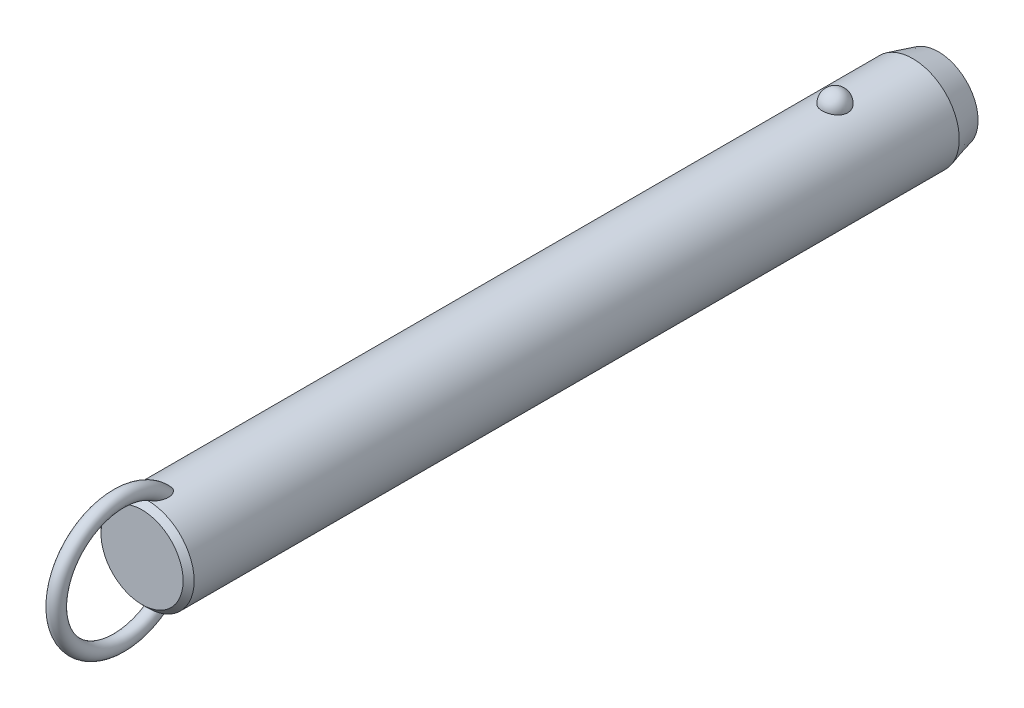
ISO-10303-21;
HEADER;
FILE_DESCRIPTION(('STEP AP214'),'2;1');
FILE_NAME('part.step','',(''),(''),'','','');
FILE_SCHEMA(('AUTOMOTIVE_DESIGN { 1 0 10303 214 1 1 1 1 }'));
ENDSEC;
DATA;
#1=APPLICATION_CONTEXT('core data for automotive mechanical design processes');
#2=APPLICATION_PROTOCOL_DEFINITION('international standard','automotive_design',2000,#1);
#3=PRODUCT_CONTEXT('',#1,'mechanical');
#4=PRODUCT('Part','Part','',(#3));
#5=PRODUCT_RELATED_PRODUCT_CATEGORY('part','',(#4));
#6=PRODUCT_DEFINITION_FORMATION('','',#4);
#7=PRODUCT_DEFINITION_CONTEXT('part definition',#1,'design');
#8=PRODUCT_DEFINITION('design','',#6,#7);
#9=PRODUCT_DEFINITION_SHAPE('','',#8);
#10=(LENGTH_UNIT() NAMED_UNIT(*) SI_UNIT(.MILLI.,.METRE.));
#11=(NAMED_UNIT(*) PLANE_ANGLE_UNIT() SI_UNIT($,.RADIAN.));
#12=(NAMED_UNIT(*) SI_UNIT($,.STERADIAN.) SOLID_ANGLE_UNIT());
#13=UNCERTAINTY_MEASURE_WITH_UNIT(LENGTH_MEASURE(1.E-05),#10,'distance_accuracy_value','');
#14=(GEOMETRIC_REPRESENTATION_CONTEXT(3) GLOBAL_UNCERTAINTY_ASSIGNED_CONTEXT((#13)) GLOBAL_UNIT_ASSIGNED_CONTEXT((#10,
#11,#12)) REPRESENTATION_CONTEXT('',''));
#15=CARTESIAN_POINT('',(0.,0.,0.));
#16=DIRECTION('',(0.,0.,1.));
#17=DIRECTION('',(1.,0.,0.));
#18=AXIS2_PLACEMENT_3D('',#15,#16,#17);
#19=CARTESIAN_POINT('',(0.,0.,172.8));
#20=DIRECTION('',(0.,0.,-1.));
#21=DIRECTION('',(-1.,0.,0.));
#22=AXIS2_PLACEMENT_3D('',#19,#20,#21);
#23=CYLINDRICAL_SURFACE('',#22,12.7);
#24=CARTESIAN_POINT('',(3.46661256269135,12.2177165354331,-3.50000000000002));
#25=CARTESIAN_POINT('',(3.4666090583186,12.2177194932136,-3.30432790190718));
#26=CARTESIAN_POINT('',(3.45063567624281,12.2222841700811,-3.10861112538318));
#27=CARTESIAN_POINT('',(3.38712451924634,12.2400345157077,-2.72271899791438));
#28=CARTESIAN_POINT('',(3.33957415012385,12.2532236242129,-2.53254588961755));
#29=CARTESIAN_POINT('',(3.2141234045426,12.286724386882,-2.16324948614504));
#30=CARTESIAN_POINT('',(3.13623639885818,12.3070329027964,-1.98412136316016));
#31=CARTESIAN_POINT('',(2.95205930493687,12.3525018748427,-1.6418059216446));
#32=CARTESIAN_POINT('',(2.84577003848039,12.3776621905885,-1.47861814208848));
#33=CARTESIAN_POINT('',(2.60688050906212,12.4301712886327,-1.17190583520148));
#34=CARTESIAN_POINT('',(2.47415697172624,12.4575299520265,-1.0284789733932));
#35=CARTESIAN_POINT('',(2.18615174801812,12.5112810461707,-0.766177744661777));
#36=CARTESIAN_POINT('',(2.03087002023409,12.5376734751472,-0.647303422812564));
#37=CARTESIAN_POINT('',(1.70237334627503,12.5864761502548,-0.437732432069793));
#38=CARTESIAN_POINT('',(1.52920948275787,12.6088972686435,-0.34695830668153));
#39=CARTESIAN_POINT('',(1.16944170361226,12.6473352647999,-0.195750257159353));
#40=CARTESIAN_POINT('',(0.982839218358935,12.663352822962,-0.135313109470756));
#41=CARTESIAN_POINT('',(0.604961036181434,12.6869706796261,-0.0473241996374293));
#42=CARTESIAN_POINT('',(0.413823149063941,12.6947125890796,-0.0192185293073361));
#43=CARTESIAN_POINT('',(0.0293827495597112,12.7014203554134,0.00517254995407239));
#44=CARTESIAN_POINT('',(-0.163919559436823,12.7003870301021,0.00146092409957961));
#45=CARTESIAN_POINT('',(-0.544374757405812,12.689735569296,-0.037393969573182));
#46=CARTESIAN_POINT('',(-0.731575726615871,12.6802364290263,-0.0721015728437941));
#47=CARTESIAN_POINT('',(-1.09733277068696,12.6538333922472,-0.171364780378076));
#48=CARTESIAN_POINT('',(-1.27588869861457,12.6369293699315,-0.235920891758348));
#49=CARTESIAN_POINT('',(-1.6204698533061,12.5973946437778,-0.393548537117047));
#50=CARTESIAN_POINT('',(-1.78641865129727,12.5747321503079,-0.486778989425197));
#51=CARTESIAN_POINT('',(-2.10030671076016,12.5261316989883,-0.699110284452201));
#52=CARTESIAN_POINT('',(-2.24824419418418,12.5001934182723,-0.818213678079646));
#53=CARTESIAN_POINT('',(-2.52491489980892,12.4472906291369,-1.0815712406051));
#54=CARTESIAN_POINT('',(-2.65324222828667,12.4203160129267,-1.22624992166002));
#55=CARTESIAN_POINT('',(-2.88410007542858,12.3687509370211,-1.53528325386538));
#56=CARTESIAN_POINT('',(-2.98662883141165,12.3441606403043,-1.69963924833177));
#57=CARTESIAN_POINT('',(-3.16432417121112,12.2998199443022,-2.04548497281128));
#58=CARTESIAN_POINT('',(-3.23917525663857,12.2801261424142,-2.22714424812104));
#59=CARTESIAN_POINT('',(-3.35800573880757,12.248167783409,-2.60091389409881));
#60=CARTESIAN_POINT('',(-3.4019860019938,12.2359030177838,-2.79302397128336));
#61=CARTESIAN_POINT('',(-3.45784812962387,12.2202347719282,-3.18140279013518));
#62=CARTESIAN_POINT('',(-3.46986123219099,12.2167950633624,-3.37765118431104));
#63=CARTESIAN_POINT('',(-3.46186273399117,12.2190638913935,-3.76943689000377));
#64=CARTESIAN_POINT('',(-3.44185196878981,12.2247721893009,-3.96497421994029));
#65=CARTESIAN_POINT('',(-3.37048652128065,12.2446381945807,-4.34881728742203));
#66=CARTESIAN_POINT('',(-3.31928253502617,12.2587552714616,-4.53715319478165));
#67=CARTESIAN_POINT('',(-3.18693461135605,12.2938237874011,-4.9023172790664));
#68=CARTESIAN_POINT('',(-3.1057895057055,12.3147754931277,-5.07914500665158));
#69=CARTESIAN_POINT('',(-2.91506431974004,12.3613125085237,-5.41732059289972));
#70=CARTESIAN_POINT('',(-2.80533587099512,12.3869217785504,-5.57858147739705));
#71=CARTESIAN_POINT('',(-2.560414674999,12.4398525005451,-5.88013283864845));
#72=CARTESIAN_POINT('',(-2.42522099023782,12.4671740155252,-6.02042254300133));
#73=CARTESIAN_POINT('',(-2.1323357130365,12.5205965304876,-6.27662798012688));
#74=CARTESIAN_POINT('',(-1.97456596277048,12.5466928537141,-6.39245542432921));
#75=CARTESIAN_POINT('',(-1.64115839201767,12.5946384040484,-6.59583547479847));
#76=CARTESIAN_POINT('',(-1.46552179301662,12.6164879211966,-6.68339001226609));
#77=CARTESIAN_POINT('',(-1.10356050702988,12.6532533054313,-6.82682153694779));
#78=CARTESIAN_POINT('',(-0.917391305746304,12.6682500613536,-6.88306988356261));
#79=CARTESIAN_POINT('',(-0.537836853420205,12.6900288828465,-6.96386887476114));
#80=CARTESIAN_POINT('',(-0.344452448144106,12.6968119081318,-6.98842322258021));
#81=CARTESIAN_POINT('',(0.0402577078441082,12.7013667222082,-7.00496469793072));
#82=CARTESIAN_POINT('',(0.231556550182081,12.6993008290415,-6.99753844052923));
#83=CARTESIAN_POINT('',(0.610105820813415,12.6867505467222,-6.95166366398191));
#84=CARTESIAN_POINT('',(0.797356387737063,12.6762664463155,-6.91321620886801));
#85=CARTESIAN_POINT('',(1.16186657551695,12.6480587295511,-6.80658431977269));
#86=CARTESIAN_POINT('',(1.33915951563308,12.6303611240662,-6.73850666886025));
#87=CARTESIAN_POINT('',(1.67968518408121,12.5896027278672,-6.57450875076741));
#88=CARTESIAN_POINT('',(1.84291705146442,12.5665416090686,-6.47858678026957));
#89=CARTESIAN_POINT('',(2.15340192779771,12.5171072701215,-6.25982455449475));
#90=CARTESIAN_POINT('',(2.30037831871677,12.4906895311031,-6.13660186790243));
#91=CARTESIAN_POINT('',(2.5717412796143,12.4376567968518,-5.86739587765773));
#92=CARTESIAN_POINT('',(2.69612388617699,12.4110417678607,-5.72140858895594));
#93=CARTESIAN_POINT('',(2.92107785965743,12.360051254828,-5.40794137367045));
#94=CARTESIAN_POINT('',(3.02121329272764,12.3357209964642,-5.24014110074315));
#95=CARTESIAN_POINT('',(3.19236291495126,12.2925446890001,-4.88969865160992));
#96=CARTESIAN_POINT('',(3.26338839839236,12.2736965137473,-4.70706226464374));
#97=CARTESIAN_POINT('',(3.36788038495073,12.245404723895,-4.35469510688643));
#98=CARTESIAN_POINT('',(3.40484026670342,12.2351018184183,-4.18605935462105));
#99=CARTESIAN_POINT('',(3.45420764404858,12.2212564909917,-3.84496058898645));
#100=CARTESIAN_POINT('',(3.46661565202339,12.2177139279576,-3.67249765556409));
#101=CARTESIAN_POINT('',(3.46661256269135,12.2177165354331,-3.50000000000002));
#102=B_SPLINE_CURVE_WITH_KNOTS('',3,(#24,#25,#26,#27,#28,#29,#30,#31,#32,#33,#34,#35,#36,#37,
#38,#39,#40,#41,#42,#43,#44,#45,#46,#47,#48,#49,#50,#51,#52,#53,#54,#55,#56,#57,#58,#59,#60,#61,
#62,#63,#64,#65,#66,#67,#68,#69,#70,#71,#72,#73,#74,#75,#76,#77,#78,#79,#80,#81,#82,#83,#84,#85,
#86,#87,#88,#89,#90,#91,#92,#93,#94,#95,#96,#97,#98,#99,#100,#101),.UNSPECIFIED.,.T.,.F.,(4,2,2,
2,2,2,2,2,2,2,2,2,2,2,2,2,2,2,2,2,2,2,2,2,2,2,2,2,2,2,2,2,2,2,2,2,2,2,4),(0.,0.586396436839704,
1.17302689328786,1.7593990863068,2.34575431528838,2.93491084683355,3.52406845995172,
4.11158733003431,4.69904375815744,5.2762784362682,5.85345931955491,6.42265312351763,
6.99185659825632,7.56427334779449,8.136746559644,8.71981013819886,9.3029135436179,
9.89247258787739,10.4820150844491,11.0691335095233,11.6562366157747,12.2405256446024,
12.8248374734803,13.412244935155,13.9996740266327,14.5891883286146,15.1786623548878,
15.7609861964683,16.3432419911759,16.914863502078,17.4864654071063,18.056024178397,
18.6256177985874,19.2037609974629,19.7820055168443,20.3699810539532,20.9577282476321,
21.4746855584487,21.9916320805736),.UNSPECIFIED.);
#103=CARTESIAN_POINT('',(3.46661256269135,12.2177165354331,-3.50000000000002));
#104=VERTEX_POINT('',#103);
#105=EDGE_CURVE('E41',#104,#104,#102,.T.);
#106=ORIENTED_EDGE('',*,*,#105,.T.);
#107=EDGE_LOOP('',(#106));
#108=FACE_BOUND('',#107,.T.);
#109=CARTESIAN_POINT('',(0.,0.,184.));
#110=DIRECTION('',(0.,0.,1.));
#111=DIRECTION('',(1.,0.,0.));
#112=AXIS2_PLACEMENT_3D('',#109,#110,#111);
#113=CIRCLE('',#112,12.7);
#114=CARTESIAN_POINT('',(12.7,0.,184.));
#115=VERTEX_POINT('',#114);
#116=EDGE_CURVE('E10',#115,#115,#113,.F.);
#117=ORIENTED_EDGE('',*,*,#116,.T.);
#118=EDGE_LOOP('',(#117));
#119=FACE_BOUND('',#118,.T.);
#120=CARTESIAN_POINT('',(-0.548122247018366,-12.6881662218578,177.743218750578));
#121=CARTESIAN_POINT('',(-0.648865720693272,-12.6838128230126,177.777926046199));
#122=CARTESIAN_POINT('',(-0.746398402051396,-12.6783867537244,177.822042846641));
#123=CARTESIAN_POINT('',(-0.932125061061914,-12.666091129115,177.926764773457));
#124=CARTESIAN_POINT('',(-1.02030388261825,-12.6592192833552,177.987396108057));
#125=CARTESIAN_POINT('',(-1.18487740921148,-12.6448747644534,178.121847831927));
#126=CARTESIAN_POINT('',(-1.26134296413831,-12.637406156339,178.195582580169));
#127=CARTESIAN_POINT('',(-1.4023120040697,-12.6225412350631,178.353604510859));
#128=CARTESIAN_POINT('',(-1.466814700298,-12.6151449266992,178.43789238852));
#129=CARTESIAN_POINT('',(-1.60714786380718,-12.5981718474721,178.649657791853));
#130=CARTESIAN_POINT('',(-1.67725126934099,-12.588900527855,178.780962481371));
#131=CARTESIAN_POINT('',(-1.79536591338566,-12.5725964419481,179.053247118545));
#132=CARTESIAN_POINT('',(-1.84333535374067,-12.5655679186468,179.194244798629));
#133=CARTESIAN_POINT('',(-1.93422576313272,-12.5519624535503,179.537645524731));
#134=CARTESIAN_POINT('',(-1.96788773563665,-12.5466298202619,179.742557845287));
#135=CARTESIAN_POINT('',(-1.9941399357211,-12.542463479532,180.051760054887));
#136=CARTESIAN_POINT('',(-1.99883864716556,-12.5417153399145,180.155298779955));
#137=CARTESIAN_POINT('',(-2.00078003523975,-12.5414074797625,180.36245124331));
#138=CARTESIAN_POINT('',(-1.99802449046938,-12.5418474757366,180.466064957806));
#139=CARTESIAN_POINT('',(-1.98336733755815,-12.5441750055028,180.71032076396));
#140=CARTESIAN_POINT('',(-1.96851430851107,-12.5465291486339,180.850780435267));
#141=CARTESIAN_POINT('',(-1.92707089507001,-12.5529612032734,181.129960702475));
#142=CARTESIAN_POINT('',(-1.90047458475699,-12.5570399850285,181.268680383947));
#143=CARTESIAN_POINT('',(-1.83619120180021,-12.5666008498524,181.54341135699));
#144=CARTESIAN_POINT('',(-1.79850828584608,-12.57208240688,181.679423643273));
#145=CARTESIAN_POINT('',(-1.71223796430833,-12.5841228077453,181.947842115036));
#146=CARTESIAN_POINT('',(-1.66365679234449,-12.5906810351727,182.080250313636));
#147=CARTESIAN_POINT('',(-1.57804503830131,-12.6016176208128,182.28548877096));
#148=CARTESIAN_POINT('',(-1.54477252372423,-12.6057501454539,182.359914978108));
#149=CARTESIAN_POINT('',(-1.47424480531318,-12.6141930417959,182.506839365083));
#150=CARTESIAN_POINT('',(-1.43699041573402,-12.6185033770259,182.579337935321));
#151=CARTESIAN_POINT('',(-1.35825795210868,-12.6272207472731,182.721892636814));
#152=CARTESIAN_POINT('',(-1.31678520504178,-12.6316276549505,182.791951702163));
#153=CARTESIAN_POINT('',(-1.22917793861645,-12.6404532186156,182.929070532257));
#154=CARTESIAN_POINT('',(-1.18304514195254,-12.6448718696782,182.996131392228));
#155=CARTESIAN_POINT('',(-1.07246411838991,-12.6547893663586,183.143874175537));
#156=CARTESIAN_POINT('',(-1.0064223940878,-12.6602600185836,183.223384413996));
#157=CARTESIAN_POINT('',(-0.864441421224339,-12.6707460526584,183.373169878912));
#158=CARTESIAN_POINT('',(-0.788516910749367,-12.6757620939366,183.443458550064));
#159=CARTESIAN_POINT('',(-0.65221547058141,-12.6833591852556,183.548680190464));
#160=CARTESIAN_POINT('',(-0.59498203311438,-12.6861973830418,183.587624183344));
#161=CARTESIAN_POINT('',(-0.475269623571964,-12.6912445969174,183.656489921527));
#162=CARTESIAN_POINT('',(-0.41280013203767,-12.6934547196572,183.686427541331));
#163=CARTESIAN_POINT('',(-0.295749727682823,-12.6966636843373,183.729756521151));
#164=CARTESIAN_POINT('',(-0.2419499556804,-12.6978134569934,183.745218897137));
#165=CARTESIAN_POINT('',(-0.13250810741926,-12.6994261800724,183.766884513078));
#166=CARTESIAN_POINT('',(-0.0768679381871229,-12.6998898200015,183.773097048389));
#167=CARTESIAN_POINT('',(0.0347696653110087,-12.7000752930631,183.775583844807));
#168=CARTESIAN_POINT('',(0.0907676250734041,-12.6997954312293,183.771835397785));
#169=CARTESIAN_POINT('',(0.201283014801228,-12.6985255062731,183.754788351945));
#170=CARTESIAN_POINT('',(0.255799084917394,-12.6975348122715,183.741481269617));
#171=CARTESIAN_POINT('',(0.376042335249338,-12.6946091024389,183.70203792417));
#172=CARTESIAN_POINT('',(0.440950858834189,-12.6924943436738,183.673449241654));
#173=CARTESIAN_POINT('',(0.565350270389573,-12.6875639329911,183.606323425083));
#174=CARTESIAN_POINT('',(0.624828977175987,-12.6847467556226,183.567764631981));
#175=CARTESIAN_POINT('',(0.774116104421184,-12.6767252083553,183.456949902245));
#176=CARTESIAN_POINT('',(0.859449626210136,-12.6711344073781,183.378760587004));
#177=CARTESIAN_POINT('',(1.01789440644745,-12.6593922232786,183.210943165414));
#178=CARTESIAN_POINT('',(1.09096902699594,-12.653239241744,183.121282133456));
#179=CARTESIAN_POINT('',(1.22268793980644,-12.6411674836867,182.940265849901));
#180=CARTESIAN_POINT('',(1.28193986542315,-12.6352572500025,182.849345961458));
#181=CARTESIAN_POINT('',(1.39259777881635,-12.6235401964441,182.662792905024));
#182=CARTESIAN_POINT('',(1.44399707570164,-12.6177334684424,182.567155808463));
#183=CARTESIAN_POINT('',(1.53972870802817,-12.6064093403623,182.372273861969));
#184=CARTESIAN_POINT('',(1.58405262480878,-12.6008922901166,182.273024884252));
#185=CARTESIAN_POINT('',(1.66600705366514,-12.5903187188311,182.071772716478));
#186=CARTESIAN_POINT('',(1.70363651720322,-12.5852622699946,181.969769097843));
#187=CARTESIAN_POINT('',(1.77545379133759,-12.5753406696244,181.754358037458));
#188=CARTESIAN_POINT('',(1.80903453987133,-12.5705328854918,181.640745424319));
#189=CARTESIAN_POINT('',(1.86844163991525,-12.5618400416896,181.411457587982));
#190=CARTESIAN_POINT('',(1.89426665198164,-12.5579551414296,181.295782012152));
#191=CARTESIAN_POINT('',(1.93785464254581,-12.5513030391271,181.063007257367));
#192=CARTESIAN_POINT('',(1.95562640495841,-12.5485346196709,180.945909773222));
#193=CARTESIAN_POINT('',(1.98264463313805,-12.5442934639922,180.710747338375));
#194=CARTESIAN_POINT('',(1.99189298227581,-12.5428204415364,180.59268260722));
#195=CARTESIAN_POINT('',(2.00416068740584,-12.540871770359,180.280622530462));
#196=CARTESIAN_POINT('',(1.99944433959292,-12.541631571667,180.086229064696));
#197=CARTESIAN_POINT('',(1.96113755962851,-12.5476846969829,179.700309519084));
#198=CARTESIAN_POINT('',(1.92758341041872,-12.5529723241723,179.508780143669));
#199=CARTESIAN_POINT('',(1.83934342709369,-12.5661532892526,179.182272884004));
#200=CARTESIAN_POINT('',(1.79215440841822,-12.5730485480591,179.04524997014));
#201=CARTESIAN_POINT('',(1.67676242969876,-12.588958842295,178.780445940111));
#202=CARTESIAN_POINT('',(1.60859050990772,-12.597970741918,178.652651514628));
#203=CARTESIAN_POINT('',(1.46583832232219,-12.6152829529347,178.435800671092));
#204=CARTESIAN_POINT('',(1.39525727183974,-12.6233659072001,178.34410500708));
#205=CARTESIAN_POINT('',(1.23992594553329,-12.6395676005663,178.173485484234));
#206=CARTESIAN_POINT('',(1.15517932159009,-12.6476863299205,178.094558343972));
#207=CARTESIAN_POINT('',(0.971995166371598,-12.6630846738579,177.952643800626));
#208=CARTESIAN_POINT('',(0.873456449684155,-12.6703572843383,177.889784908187));
#209=CARTESIAN_POINT('',(0.665847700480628,-12.6829569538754,177.784487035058));
#210=CARTESIAN_POINT('',(0.556784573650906,-12.688285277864,177.742034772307));
#211=CARTESIAN_POINT('',(0.347338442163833,-12.6956226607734,177.684443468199));
#212=CARTESIAN_POINT('',(0.247759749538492,-12.6979816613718,177.666399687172));
#213=CARTESIAN_POINT('',(0.0470218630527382,-12.7003077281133,177.648600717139));
#214=CARTESIAN_POINT('',(-0.0541350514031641,-12.7002779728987,177.648821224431));
#215=CARTESIAN_POINT('',(-0.221414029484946,-12.6982482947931,177.664363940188));
#216=CARTESIAN_POINT('',(-0.288055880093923,-12.6969033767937,177.674666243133));
#217=CARTESIAN_POINT('',(-0.419599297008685,-12.6932369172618,177.70313489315));
#218=CARTESIAN_POINT('',(-0.484501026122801,-12.6909154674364,177.721300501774));
#219=CARTESIAN_POINT('',(-0.548122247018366,-12.6881662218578,177.743218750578));
#220=B_SPLINE_CURVE_WITH_KNOTS('',3,(#120,#121,#122,#123,#124,#125,#126,#127,#128,#129,#130,
#131,#132,#133,#134,#135,#136,#137,#138,#139,#140,#141,#142,#143,#144,#145,#146,#147,#148,#149,
#150,#151,#152,#153,#154,#155,#156,#157,#158,#159,#160,#161,#162,#163,#164,#165,#166,#167,#168,
#169,#170,#171,#172,#173,#174,#175,#176,#177,#178,#179,#180,#181,#182,#183,#184,#185,#186,#187,
#188,#189,#190,#191,#192,#193,#194,#195,#196,#197,#198,#199,#200,#201,#202,#203,#204,#205,#206,
#207,#208,#209,#210,#211,#212,#213,#214,#215,#216,#217,#218,#219),.UNSPECIFIED.,.T.,.F.,(4,2,2,
2,2,2,2,2,2,2,2,2,2,2,2,2,2,2,2,2,2,2,2,2,2,2,2,2,2,2,2,2,2,2,2,2,2,2,2,2,2,2,2,2,2,2,2,2,2,4),
(0.,0.31964225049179,0.639794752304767,0.957927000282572,1.27608021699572,1.72100165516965,
2.16675988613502,2.78630021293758,3.09705782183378,3.40774128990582,3.83096358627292,
4.25439969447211,4.67767724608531,5.1007133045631,5.34550297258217,5.59024267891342,
5.83467707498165,6.07902143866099,6.38891080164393,6.69834321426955,6.9056091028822,
7.11250749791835,7.27977315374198,7.44687060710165,7.61434932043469,7.78197685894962,
7.99365544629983,8.20579780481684,8.55147335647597,8.89816429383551,9.22375138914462,
9.54961437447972,9.87586224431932,10.202161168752,10.557587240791,10.9130746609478,
11.2681734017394,11.6231936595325,12.2046601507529,12.7853961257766,13.219164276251,
13.6522938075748,13.9989174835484,14.3454519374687,14.6946768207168,15.0436740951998,
15.3457513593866,15.6474266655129,15.8493051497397,16.0511646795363),.UNSPECIFIED.);
#221=CARTESIAN_POINT('',(-0.548122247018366,-12.6881662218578,177.743218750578));
#222=VERTEX_POINT('',#221);
#223=EDGE_CURVE('E59',#222,#222,#220,.T.);
#224=ORIENTED_EDGE('',*,*,#223,.T.);
#225=EDGE_LOOP('',(#224));
#226=FACE_BOUND('',#225,.T.);
#227=CARTESIAN_POINT('',(-0.548122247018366,12.6881662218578,177.743218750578));
#228=CARTESIAN_POINT('',(-0.459436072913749,12.6919968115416,177.712673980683));
#229=CARTESIAN_POINT('',(-0.368189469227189,12.6949996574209,177.689391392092));
#230=CARTESIAN_POINT('',(-0.18302400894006,12.6990186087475,177.658406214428));
#231=CARTESIAN_POINT('',(-0.089104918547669,12.7000345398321,177.650704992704));
#232=CARTESIAN_POINT('',(0.0987147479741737,12.6999636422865,177.651245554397));
#233=CARTESIAN_POINT('',(0.192615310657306,12.6988761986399,177.659492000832));
#234=CARTESIAN_POINT('',(0.377658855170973,12.6947211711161,177.691551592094));
#235=CARTESIAN_POINT('',(0.468801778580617,12.6916535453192,177.715365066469));
#236=CARTESIAN_POINT('',(0.645809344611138,12.6838788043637,177.77745651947));
#237=CARTESIAN_POINT('',(0.731679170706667,12.6791733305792,177.815720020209));
#238=CARTESIAN_POINT('',(0.896315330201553,12.6686004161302,177.905120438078));
#239=CARTESIAN_POINT('',(0.97508059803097,12.6627328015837,177.956259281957));
#240=CARTESIAN_POINT('',(1.12963655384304,12.6499161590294,178.07367820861));
#241=CARTESIAN_POINT('',(1.20478673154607,12.6429194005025,178.140792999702));
#242=CARTESIAN_POINT('',(1.34448241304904,12.6288282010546,178.28522507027));
#243=CARTESIAN_POINT('',(1.40902173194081,12.621733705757,178.362548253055));
#244=CARTESIAN_POINT('',(1.55208211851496,12.6050877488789,178.559247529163));
#245=CARTESIAN_POINT('',(1.62510490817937,12.5957546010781,178.682654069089));
#246=CARTESIAN_POINT('',(1.7501904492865,12.5789823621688,178.939769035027));
#247=CARTESIAN_POINT('',(1.80221377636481,12.5715468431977,179.073496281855));
#248=CARTESIAN_POINT('',(1.90309965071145,12.5567434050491,179.398351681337));
#249=CARTESIAN_POINT('',(1.94342317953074,12.5504515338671,179.592161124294));
#250=CARTESIAN_POINT('',(1.99332997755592,12.5426147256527,179.98378810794));
#251=CARTESIAN_POINT('',(2.00285305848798,12.5410790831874,180.181612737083));
#252=CARTESIAN_POINT('',(1.99678999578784,12.5420407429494,180.516642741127));
#253=CARTESIAN_POINT('',(1.98794117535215,12.5434564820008,180.654042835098));
#254=CARTESIAN_POINT('',(1.95865119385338,12.5480641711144,180.927639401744));
#255=CARTESIAN_POINT('',(1.93820436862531,12.5512569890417,181.063835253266));
#256=CARTESIAN_POINT('',(1.88647896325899,12.5591352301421,181.334249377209));
#257=CARTESIAN_POINT('',(1.85518800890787,12.5638223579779,181.468465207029));
#258=CARTESIAN_POINT('',(1.78217886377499,12.5743868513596,181.733936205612));
#259=CARTESIAN_POINT('',(1.74046509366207,12.5802637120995,181.865192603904));
#260=CARTESIAN_POINT('',(1.66024095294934,12.5910571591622,182.086085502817));
#261=CARTESIAN_POINT('',(1.62434772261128,12.5957535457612,182.176690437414));
#262=CARTESIAN_POINT('',(1.54709009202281,12.6054762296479,182.355512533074));
#263=CARTESIAN_POINT('',(1.50572681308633,12.6105024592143,182.443730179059));
#264=CARTESIAN_POINT('',(1.41728020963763,12.620748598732,182.616932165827));
#265=CARTESIAN_POINT('',(1.37021377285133,12.625967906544,182.701925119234));
#266=CARTESIAN_POINT('',(1.26969620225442,12.6364721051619,182.868007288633));
#267=CARTESIAN_POINT('',(1.21624929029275,12.6417569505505,182.949099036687));
#268=CARTESIAN_POINT('',(1.10304413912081,12.6521331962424,183.104702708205));
#269=CARTESIAN_POINT('',(1.04340936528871,12.657226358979,183.179303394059));
#270=CARTESIAN_POINT('',(0.915919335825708,12.667090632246,183.321324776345));
#271=CARTESIAN_POINT('',(0.84806456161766,12.6718617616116,183.38874589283));
#272=CARTESIAN_POINT('',(0.717035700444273,12.67987711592,183.500624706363));
#273=CARTESIAN_POINT('',(0.655526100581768,12.6832377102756,183.546997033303));
#274=CARTESIAN_POINT('',(0.525985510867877,12.6892676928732,183.629619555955));
#275=CARTESIAN_POINT('',(0.457969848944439,12.6919386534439,183.665892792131));
#276=CARTESIAN_POINT('',(0.334859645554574,12.695691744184,183.716657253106));
#277=CARTESIAN_POINT('',(0.281116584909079,12.6970073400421,183.734373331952));
#278=CARTESIAN_POINT('',(0.171425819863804,12.6989609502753,183.760642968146));
#279=CARTESIAN_POINT('',(0.115480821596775,12.699599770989,183.769207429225));
#280=CARTESIAN_POINT('',(0.00272618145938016,12.7001251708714,183.776253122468));
#281=CARTESIAN_POINT('',(-0.0540859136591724,12.7000089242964,183.774696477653));
#282=CARTESIAN_POINT('',(-0.16654462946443,12.6990328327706,183.761600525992));
#283=CARTESIAN_POINT('',(-0.222190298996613,12.6981724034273,183.750053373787));
#284=CARTESIAN_POINT('',(-0.342018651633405,12.695562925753,183.714912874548));
#285=CARTESIAN_POINT('',(-0.405606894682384,12.6936676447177,183.68933225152));
#286=CARTESIAN_POINT('',(-0.527815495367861,12.6891754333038,183.628311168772));
#287=CARTESIAN_POINT('',(-0.586425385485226,12.6865770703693,183.592850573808));
#288=CARTESIAN_POINT('',(-0.731842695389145,12.6792129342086,183.491496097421));
#289=CARTESIAN_POINT('',(-0.81470941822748,12.6740767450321,183.4200395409));
#290=CARTESIAN_POINT('',(-0.969101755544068,12.6632083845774,183.26589007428));
#291=CARTESIAN_POINT('',(-1.04059564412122,12.6574746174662,183.183166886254));
#292=CARTESIAN_POINT('',(-1.16981116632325,12.6461638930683,183.015809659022));
#293=CARTESIAN_POINT('',(-1.22811369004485,12.6405994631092,182.931616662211));
#294=CARTESIAN_POINT('',(-1.33743405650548,12.6295007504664,182.758579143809));
#295=CARTESIAN_POINT('',(-1.38844577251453,12.6239664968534,182.669730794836));
#296=CARTESIAN_POINT('',(-1.48400702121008,12.6130898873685,182.488389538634));
#297=CARTESIAN_POINT('',(-1.52854232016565,12.6077479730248,182.395889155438));
#298=CARTESIAN_POINT('',(-1.61150113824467,12.5974127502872,182.208160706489));
#299=CARTESIAN_POINT('',(-1.64992317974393,12.5924195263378,182.112931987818));
#300=CARTESIAN_POINT('',(-1.73468589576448,12.581070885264,181.88289362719));
#301=CARTESIAN_POINT('',(-1.77831261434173,12.5749388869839,181.747066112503));
#302=CARTESIAN_POINT('',(-1.85439734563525,12.5639437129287,181.472212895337));
#303=CARTESIAN_POINT('',(-1.88684994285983,12.5590811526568,181.333185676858));
#304=CARTESIAN_POINT('',(-1.94008483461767,12.550968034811,181.05309235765));
#305=CARTESIAN_POINT('',(-1.96088706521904,12.5477147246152,180.912030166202));
#306=CARTESIAN_POINT('',(-1.99000539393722,12.5431291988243,180.628668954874));
#307=CARTESIAN_POINT('',(-1.99832911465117,12.5417958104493,180.486370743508));
#308=CARTESIAN_POINT('',(-2.00166624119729,12.5412674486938,180.157627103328));
#309=CARTESIAN_POINT('',(-1.99178843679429,12.5428579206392,179.971088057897));
#310=CARTESIAN_POINT('',(-1.94455183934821,12.5502731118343,179.60162404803));
#311=CARTESIAN_POINT('',(-1.90724032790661,12.5560905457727,179.418693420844));
#312=CARTESIAN_POINT('',(-1.81330718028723,12.5699462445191,179.104848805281));
#313=CARTESIAN_POINT('',(-1.76338820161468,12.5771273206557,178.971910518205));
#314=CARTESIAN_POINT('',(-1.64305018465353,12.593414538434,178.715681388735));
#315=CARTESIAN_POINT('',(-1.57265346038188,12.6025185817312,178.592380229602));
#316=CARTESIAN_POINT('',(-1.42634956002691,12.6198178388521,178.383564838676));
#317=CARTESIAN_POINT('',(-1.35423772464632,12.6278405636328,178.295384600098));
#318=CARTESIAN_POINT('',(-1.19645664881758,12.6437632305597,178.132107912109));
#319=CARTESIAN_POINT('',(-1.1108053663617,12.6516633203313,178.056994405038));
#320=CARTESIAN_POINT('',(-0.947219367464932,12.6648319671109,177.937811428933));
#321=CARTESIAN_POINT('',(-0.871624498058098,12.670300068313,177.890541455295));
#322=CARTESIAN_POINT('',(-0.714161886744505,12.6801492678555,177.8077413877));
#323=CARTESIAN_POINT('',(-0.632295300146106,12.684530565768,177.77220913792));
#324=CARTESIAN_POINT('',(-0.548122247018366,12.6881662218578,177.743218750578));
#325=B_SPLINE_CURVE_WITH_KNOTS('',3,(#227,#228,#229,#230,#231,#232,#233,#234,#235,#236,#237,
#238,#239,#240,#241,#242,#243,#244,#245,#246,#247,#248,#249,#250,#251,#252,#253,#254,#255,#256,
#257,#258,#259,#260,#261,#262,#263,#264,#265,#266,#267,#268,#269,#270,#271,#272,#273,#274,#275,
#276,#277,#278,#279,#280,#281,#282,#283,#284,#285,#286,#287,#288,#289,#290,#291,#292,#293,#294,
#295,#296,#297,#298,#299,#300,#301,#302,#303,#304,#305,#306,#307,#308,#309,#310,#311,#312,#313,
#314,#315,#316,#317,#318,#319,#320,#321,#322,#323,#324),.UNSPECIFIED.,.T.,.F.,(4,2,2,2,2,2,2,2,
2,2,2,2,2,2,2,2,2,2,2,2,2,2,2,2,2,2,2,2,2,2,2,2,2,2,2,2,2,2,2,2,2,2,2,2,2,2,2,2,4),(0.,
0.281328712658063,0.562682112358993,0.844117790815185,1.12555942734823,1.40671982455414,
1.68792232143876,1.98972294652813,2.29169886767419,2.72039860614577,3.14989948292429,
3.74084916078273,4.33295293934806,4.74554109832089,5.15833092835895,5.57159335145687,
5.98468079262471,6.27722775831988,6.56971484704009,6.86135609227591,7.15280542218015,
7.43927407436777,7.72572595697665,7.95635862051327,8.18646071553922,8.35559393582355,
8.52452541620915,8.69408946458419,8.86378678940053,9.06834348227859,9.27332014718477,
9.60010414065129,9.92778432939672,10.2350252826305,10.5425229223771,10.8506864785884,
11.15892440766,11.5867893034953,12.0148612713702,12.4421984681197,12.8692745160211,
13.4279365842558,13.9856380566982,14.4107062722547,14.835313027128,15.1765567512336,
15.517351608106,15.7844129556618,16.051425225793),.UNSPECIFIED.);
#326=CARTESIAN_POINT('',(-0.548122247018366,12.6881662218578,177.743218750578));
#327=VERTEX_POINT('',#326);
#328=EDGE_CURVE('E66',#327,#327,#325,.T.);
#329=ORIENTED_EDGE('',*,*,#328,.T.);
#330=EDGE_LOOP('',(#329));
#331=FACE_BOUND('',#330,.T.);
#332=CARTESIAN_POINT('',(0.,0.,-24.7000000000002));
#333=DIRECTION('',(0.,0.,-1.));
#334=DIRECTION('',(-1.,0.,0.));
#335=AXIS2_PLACEMENT_3D('',#332,#333,#334);
#336=CIRCLE('',#335,12.7);
#337=CARTESIAN_POINT('',(-12.7,0.,-24.7000000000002));
#338=VERTEX_POINT('',#337);
#339=EDGE_CURVE('E56',#338,#338,#336,.F.);
#340=ORIENTED_EDGE('',*,*,#339,.T.);
#341=EDGE_LOOP('',(#340));
#342=FACE_BOUND('',#341,.T.);
#343=ADVANCED_FACE('F37',(#108,#119,#226,#331,#342),#23,.T.);
#344=CARTESIAN_POINT('',(0.,0.,-31.7));
#345=DIRECTION('',(0.,0.,-1.));
#346=DIRECTION('',(-1.,0.,0.));
#347=AXIS2_PLACEMENT_3D('',#344,#345,#346);
#348=PLANE('',#347);
#349=CARTESIAN_POINT('',(0.,0.,-31.7));
#350=DIRECTION('',(0.,0.,-1.));
#351=DIRECTION('',(-1.,0.,0.));
#352=AXIS2_PLACEMENT_3D('',#349,#350,#351);
#353=CIRCLE('',#352,10.8243556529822);
#354=CARTESIAN_POINT('',(-10.8243556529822,0.,-31.7));
#355=VERTEX_POINT('',#354);
#356=EDGE_CURVE('E65',#355,#355,#353,.T.);
#357=ORIENTED_EDGE('',*,*,#356,.T.);
#358=EDGE_LOOP('',(#357));
#359=FACE_BOUND('',#358,.T.);
#360=ADVANCED_FACE('F84',(#359),#348,.T.);
#361=CARTESIAN_POINT('',(0.,0.,-31.7));
#362=DIRECTION('',(0.,0.,1.));
#363=DIRECTION('',(1.,0.,0.));
#364=AXIS2_PLACEMENT_3D('',#361,#362,#363);
#365=CONICAL_SURFACE('',#364,10.8243556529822,0.261799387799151);
#366=ORIENTED_EDGE('',*,*,#339,.F.);
#367=EDGE_LOOP('',(#366));
#368=FACE_BOUND('',#367,.T.);
#369=ORIENTED_EDGE('',*,*,#356,.F.);
#370=EDGE_LOOP('',(#369));
#371=FACE_BOUND('',#370,.T.);
#372=ADVANCED_FACE('F82',(#368,#371),#365,.T.);
#373=CARTESIAN_POINT('',(0.,0.,185.5));
#374=DIRECTION('',(0.,0.,1.));
#375=DIRECTION('',(1.,0.,0.));
#376=AXIS2_PLACEMENT_3D('',#373,#374,#375);
#377=PLANE('',#376);
#378=CARTESIAN_POINT('',(0.,0.,185.5));
#379=DIRECTION('',(0.,0.,1.));
#380=DIRECTION('',(1.,0.,0.));
#381=AXIS2_PLACEMENT_3D('',#378,#379,#380);
#382=CIRCLE('',#381,11.2000000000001);
#383=CARTESIAN_POINT('',(11.2000000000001,0.,185.5));
#384=VERTEX_POINT('',#383);
#385=EDGE_CURVE('E50',#384,#384,#382,.T.);
#386=ORIENTED_EDGE('',*,*,#385,.T.);
#387=EDGE_LOOP('',(#386));
#388=FACE_BOUND('',#387,.T.);
#389=ADVANCED_FACE('F76',(#388),#377,.T.);
#390=CARTESIAN_POINT('',(0.,0.,191.85));
#391=DIRECTION('',(1.,0.,0.));
#392=DIRECTION('',(0.,0.,-1.));
#393=AXIS2_PLACEMENT_3D('',#390,#391,#392);
#394=TOROIDAL_SURFACE('',#393,17.05,2.);
#395=ORIENTED_EDGE('',*,*,#328,.F.);
#396=EDGE_LOOP('',(#395));
#397=FACE_BOUND('',#396,.T.);
#398=ORIENTED_EDGE('',*,*,#223,.F.);
#399=EDGE_LOOP('',(#398));
#400=FACE_BOUND('',#399,.T.);
#401=ADVANCED_FACE('F72',(#397,#400),#394,.T.);
#402=CARTESIAN_POINT('',(0.,0.,185.5));
#403=DIRECTION('',(0.,0.,-1.));
#404=DIRECTION('',(-1.,0.,0.));
#405=AXIS2_PLACEMENT_3D('',#402,#403,#404);
#406=CONICAL_SURFACE('',#405,11.2000000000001,0.785398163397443);
#407=ORIENTED_EDGE('',*,*,#116,.F.);
#408=EDGE_LOOP('',(#407));
#409=FACE_BOUND('',#408,.T.);
#410=ORIENTED_EDGE('',*,*,#385,.F.);
#411=EDGE_LOOP('',(#410));
#412=FACE_BOUND('',#411,.T.);
#413=ADVANCED_FACE('F39',(#409,#412),#406,.T.);
#414=CARTESIAN_POINT('',(0.,12.7,-3.50000000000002));
#415=DIRECTION('',(0.,1.,0.));
#416=DIRECTION('',(0.,0.,-1.));
#417=AXIS2_PLACEMENT_3D('',#414,#415,#416);
#418=SPHERICAL_SURFACE('',#417,3.5);
#419=ORIENTED_EDGE('',*,*,#105,.F.);
#420=EDGE_LOOP('',(#419));
#421=FACE_BOUND('',#420,.T.);
#422=ADVANCED_FACE('F78',(#421),#418,.T.);
#423=CLOSED_SHELL('',(#343,#360,#372,#389,#401,#413,#422));
#424=MANIFOLD_SOLID_BREP('B2',#423);
#425=ADVANCED_BREP_SHAPE_REPRESENTATION('',(#18,#424),#14);
#426=SHAPE_DEFINITION_REPRESENTATION(#9,#425);
ENDSEC;
END-ISO-10303-21;
